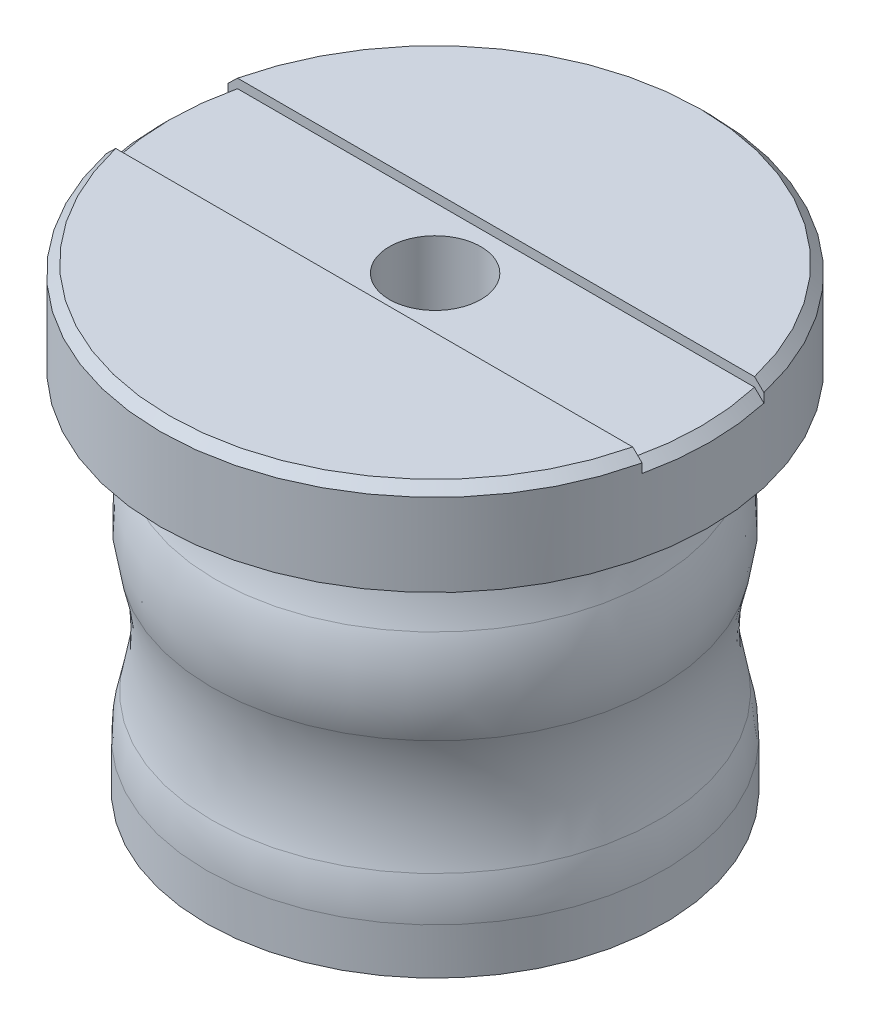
ISO-10303-21;
HEADER;
FILE_DESCRIPTION(('STEP AP214'),'2;1');
FILE_NAME('part.step','',(''),(''),'','','');
FILE_SCHEMA(('AUTOMOTIVE_DESIGN { 1 0 10303 214 1 1 1 1 }'));
ENDSEC;
DATA;
#1=APPLICATION_CONTEXT('core data for automotive mechanical design processes');
#2=APPLICATION_PROTOCOL_DEFINITION('international standard','automotive_design',2000,#1);
#3=PRODUCT_CONTEXT('',#1,'mechanical');
#4=PRODUCT('Part','Part','',(#3));
#5=PRODUCT_RELATED_PRODUCT_CATEGORY('part','',(#4));
#6=PRODUCT_DEFINITION_FORMATION('','',#4);
#7=PRODUCT_DEFINITION_CONTEXT('part definition',#1,'design');
#8=PRODUCT_DEFINITION('design','',#6,#7);
#9=PRODUCT_DEFINITION_SHAPE('','',#8);
#10=(LENGTH_UNIT() NAMED_UNIT(*) SI_UNIT(.MILLI.,.METRE.));
#11=(NAMED_UNIT(*) PLANE_ANGLE_UNIT() SI_UNIT($,.RADIAN.));
#12=(NAMED_UNIT(*) SI_UNIT($,.STERADIAN.) SOLID_ANGLE_UNIT());
#13=UNCERTAINTY_MEASURE_WITH_UNIT(LENGTH_MEASURE(1.E-05),#10,'distance_accuracy_value','');
#14=(GEOMETRIC_REPRESENTATION_CONTEXT(3) GLOBAL_UNCERTAINTY_ASSIGNED_CONTEXT((#13)) GLOBAL_UNIT_ASSIGNED_CONTEXT((#10,
#11,#12)) REPRESENTATION_CONTEXT('',''));
#15=CARTESIAN_POINT('',(0.,0.,0.));
#16=DIRECTION('',(0.,0.,1.));
#17=DIRECTION('',(1.,0.,0.));
#18=AXIS2_PLACEMENT_3D('',#15,#16,#17);
#19=CARTESIAN_POINT('',(-2.5,-3.99999999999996,0.));
#20=DIRECTION('',(0.,-1.,0.));
#21=DIRECTION('',(0.,0.,-1.));
#22=AXIS2_PLACEMENT_3D('',#19,#20,#21);
#23=PLANE('',#22);
#24=CARTESIAN_POINT('',(0.,-3.99999999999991,0.));
#25=DIRECTION('',(0.,1.,0.));
#26=DIRECTION('',(0.,0.,1.));
#27=AXIS2_PLACEMENT_3D('',#24,#25,#26);
#28=CIRCLE('',#27,2.49999999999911);
#29=CARTESIAN_POINT('',(0.,-3.99999999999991,2.49999999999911));
#30=VERTEX_POINT('',#29);
#31=EDGE_CURVE('E291',#30,#30,#28,.T.);
#32=ORIENTED_EDGE('',*,*,#31,.F.);
#33=EDGE_LOOP('',(#32));
#34=FACE_BOUND('',#33,.T.);
#35=CARTESIAN_POINT('',(0.,-3.99999999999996,0.));
#36=DIRECTION('',(0.,1.,0.));
#37=DIRECTION('',(0.,0.,1.));
#38=AXIS2_PLACEMENT_3D('',#35,#36,#37);
#39=CIRCLE('',#38,1.99999980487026);
#40=CARTESIAN_POINT('',(0.,-3.99999999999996,1.99999980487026));
#41=VERTEX_POINT('',#40);
#42=EDGE_CURVE('E163',#41,#41,#39,.T.);
#43=ORIENTED_EDGE('',*,*,#42,.T.);
#44=EDGE_LOOP('',(#43));
#45=FACE_BOUND('',#44,.T.);
#46=ADVANCED_FACE('F37',(#34,#45),#23,.T.);
#47=CARTESIAN_POINT('',(0.,1.,0.));
#48=DIRECTION('',(0.,1.,0.));
#49=DIRECTION('',(0.,0.,1.));
#50=AXIS2_PLACEMENT_3D('',#47,#48,#49);
#51=PLANE('',#50);
#52=DIRECTION('',(1.,0.,0.));
#53=VECTOR('',#52,1.);
#54=CARTESIAN_POINT('',(0.,1.,0.665));
#55=LINE('',#54,#53);
#56=CARTESIAN_POINT('',(-2.82272474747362,1.,0.665));
#57=VERTEX_POINT('',#56);
#58=CARTESIAN_POINT('',(2.82272474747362,1.,0.665));
#59=VERTEX_POINT('',#58);
#60=EDGE_CURVE('E306',#57,#59,#55,.T.);
#61=ORIENTED_EDGE('',*,*,#60,.F.);
#62=CARTESIAN_POINT('',(0.,1.,0.));
#63=DIRECTION('',(0.,1.,0.));
#64=DIRECTION('',(0.,0.,1.));
#65=AXIS2_PLACEMENT_3D('',#62,#63,#64);
#66=CIRCLE('',#65,2.9);
#67=EDGE_CURVE('E331',#57,#59,#66,.T.);
#68=ORIENTED_EDGE('',*,*,#67,.T.);
#69=EDGE_LOOP('',(#61,#68));
#70=FACE_BOUND('',#69,.T.);
#71=ADVANCED_FACE('F238',(#70),#51,.T.);
#72=CARTESIAN_POINT('',(0.,1.,0.));
#73=DIRECTION('',(0.,-1.,0.));
#74=DIRECTION('',(0.,0.,-1.));
#75=AXIS2_PLACEMENT_3D('',#72,#73,#74);
#76=CYLINDRICAL_SURFACE('',#75,3.);
#77=CARTESIAN_POINT('',(0.,0.9,0.));
#78=DIRECTION('',(0.,1.,0.));
#79=DIRECTION('',(0.,0.,1.));
#80=AXIS2_PLACEMENT_3D('',#77,#78,#79);
#81=CIRCLE('',#80,3.);
#82=CARTESIAN_POINT('',(2.9253674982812,0.9,0.665));
#83=VERTEX_POINT('',#82);
#84=CARTESIAN_POINT('',(-2.9253674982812,0.9,0.665));
#85=VERTEX_POINT('',#84);
#86=EDGE_CURVE('E324',#83,#85,#81,.F.);
#87=ORIENTED_EDGE('',*,*,#86,.T.);
#88=DIRECTION('',(0.,-1.,0.));
#89=VECTOR('',#88,1.);
#90=CARTESIAN_POINT('',(-2.9253674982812,1.,0.665));
#91=LINE('',#90,#89);
#92=CARTESIAN_POINT('',(-2.9253674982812,0.8,0.665));
#93=VERTEX_POINT('',#92);
#94=EDGE_CURVE('E64',#85,#93,#91,.T.);
#95=ORIENTED_EDGE('',*,*,#94,.T.);
#96=CARTESIAN_POINT('',(0.,0.8,0.));
#97=DIRECTION('',(0.,-1.,0.));
#98=DIRECTION('',(0.,0.,-1.));
#99=AXIS2_PLACEMENT_3D('',#96,#97,#98);
#100=CIRCLE('',#99,3.);
#101=CARTESIAN_POINT('',(-2.9253674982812,0.8,-0.665));
#102=VERTEX_POINT('',#101);
#103=EDGE_CURVE('E318',#93,#102,#100,.T.);
#104=ORIENTED_EDGE('',*,*,#103,.T.);
#105=DIRECTION('',(0.,-1.,0.));
#106=VECTOR('',#105,1.);
#107=CARTESIAN_POINT('',(-2.9253674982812,1.,-0.665));
#108=LINE('',#107,#106);
#109=CARTESIAN_POINT('',(-2.9253674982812,0.9,-0.665));
#110=VERTEX_POINT('',#109);
#111=EDGE_CURVE('E315',#102,#110,#108,.F.);
#112=ORIENTED_EDGE('',*,*,#111,.T.);
#113=CARTESIAN_POINT('',(0.,0.9,0.));
#114=DIRECTION('',(0.,1.,0.));
#115=DIRECTION('',(0.,0.,1.));
#116=AXIS2_PLACEMENT_3D('',#113,#114,#115);
#117=CIRCLE('',#116,3.);
#118=CARTESIAN_POINT('',(2.9253674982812,0.9,-0.665));
#119=VERTEX_POINT('',#118);
#120=EDGE_CURVE('E309',#110,#119,#117,.F.);
#121=ORIENTED_EDGE('',*,*,#120,.T.);
#122=DIRECTION('',(0.,-1.,0.));
#123=VECTOR('',#122,1.);
#124=CARTESIAN_POINT('',(2.9253674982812,1.,-0.665));
#125=LINE('',#124,#123);
#126=CARTESIAN_POINT('',(2.9253674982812,0.8,-0.665));
#127=VERTEX_POINT('',#126);
#128=EDGE_CURVE('E56',#119,#127,#125,.T.);
#129=ORIENTED_EDGE('',*,*,#128,.T.);
#130=CARTESIAN_POINT('',(0.,0.8,0.));
#131=DIRECTION('',(0.,-1.,0.));
#132=DIRECTION('',(0.,0.,-1.));
#133=AXIS2_PLACEMENT_3D('',#130,#131,#132);
#134=CIRCLE('',#133,3.);
#135=CARTESIAN_POINT('',(2.9253674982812,0.8,0.665));
#136=VERTEX_POINT('',#135);
#137=EDGE_CURVE('E312',#127,#136,#134,.T.);
#138=ORIENTED_EDGE('',*,*,#137,.T.);
#139=DIRECTION('',(0.,-1.,0.));
#140=VECTOR('',#139,1.);
#141=CARTESIAN_POINT('',(2.9253674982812,1.,0.665));
#142=LINE('',#141,#140);
#143=EDGE_CURVE('E321',#136,#83,#142,.F.);
#144=ORIENTED_EDGE('',*,*,#143,.T.);
#145=EDGE_LOOP('',(#87,#95,#104,#112,#121,#129,#138,#144));
#146=FACE_BOUND('',#145,.T.);
#147=CARTESIAN_POINT('',(0.,0.,0.));
#148=DIRECTION('',(0.,1.,0.));
#149=DIRECTION('',(0.,0.,1.));
#150=AXIS2_PLACEMENT_3D('',#147,#148,#149);
#151=CIRCLE('',#150,3.);
#152=CARTESIAN_POINT('',(0.,0.,3.));
#153=VERTEX_POINT('',#152);
#154=EDGE_CURVE('E300',#153,#153,#151,.T.);
#155=ORIENTED_EDGE('',*,*,#154,.T.);
#156=EDGE_LOOP('',(#155));
#157=FACE_BOUND('',#156,.T.);
#158=ADVANCED_FACE('F245',(#146,#157),#76,.T.);
#159=DIRECTION('',(-1.,0.,0.));
#160=VECTOR('',#159,1.);
#161=CARTESIAN_POINT('',(0.,1.,-0.665));
#162=LINE('',#161,#160);
#163=CARTESIAN_POINT('',(2.82272474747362,1.,-0.665));
#164=VERTEX_POINT('',#163);
#165=CARTESIAN_POINT('',(-2.82272474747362,1.,-0.665));
#166=VERTEX_POINT('',#165);
#167=EDGE_CURVE('E303',#164,#166,#162,.T.);
#168=ORIENTED_EDGE('',*,*,#167,.F.);
#169=CARTESIAN_POINT('',(0.,1.,0.));
#170=DIRECTION('',(0.,1.,0.));
#171=DIRECTION('',(0.,0.,1.));
#172=AXIS2_PLACEMENT_3D('',#169,#170,#171);
#173=CIRCLE('',#172,2.9);
#174=EDGE_CURVE('E389',#164,#166,#173,.T.);
#175=ORIENTED_EDGE('',*,*,#174,.T.);
#176=EDGE_LOOP('',(#168,#175));
#177=FACE_BOUND('',#176,.T.);
#178=ADVANCED_FACE('F248',(#177),#51,.T.);
#179=CARTESIAN_POINT('',(0.,0.,0.));
#180=DIRECTION('',(0.,1.,0.));
#181=DIRECTION('',(0.,0.,1.));
#182=AXIS2_PLACEMENT_3D('',#179,#180,#181);
#183=PLANE('',#182);
#184=CARTESIAN_POINT('',(0.,0.,0.));
#185=DIRECTION('',(0.,1.,0.));
#186=DIRECTION('',(0.,0.,1.));
#187=AXIS2_PLACEMENT_3D('',#184,#185,#186);
#188=CIRCLE('',#187,2.25);
#189=CARTESIAN_POINT('',(0.,0.,2.25));
#190=VERTEX_POINT('',#189);
#191=EDGE_CURVE('E270',#190,#190,#188,.T.);
#192=ORIENTED_EDGE('',*,*,#191,.T.);
#193=EDGE_LOOP('',(#192));
#194=FACE_BOUND('',#193,.T.);
#195=ORIENTED_EDGE('',*,*,#154,.F.);
#196=EDGE_LOOP('',(#195));
#197=FACE_BOUND('',#196,.T.);
#198=ADVANCED_FACE('F379',(#194,#197),#183,.F.);
#199=CARTESIAN_POINT('',(0.,0.9,0.));
#200=DIRECTION('',(0.,-1.,0.));
#201=DIRECTION('',(0.,0.,-1.));
#202=AXIS2_PLACEMENT_3D('',#199,#200,#201);
#203=PLANE('',#202);
#204=CARTESIAN_POINT('',(0.,0.9,0.));
#205=DIRECTION('',(0.,1.,0.));
#206=DIRECTION('',(0.,0.,1.));
#207=AXIS2_PLACEMENT_3D('',#204,#205,#206);
#208=CIRCLE('',#207,0.5);
#209=CARTESIAN_POINT('',(0.,0.9,0.5));
#210=VERTEX_POINT('',#209);
#211=EDGE_CURVE('E271',#210,#210,#208,.T.);
#212=ORIENTED_EDGE('',*,*,#211,.F.);
#213=EDGE_LOOP('',(#212));
#214=FACE_BOUND('',#213,.T.);
#215=DIRECTION('',(-1.,0.,0.));
#216=VECTOR('',#215,1.);
#217=CARTESIAN_POINT('',(-4.25,0.9,-0.665));
#218=LINE('',#217,#216);
#219=CARTESIAN_POINT('',(2.82272474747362,0.9,-0.665));
#220=VERTEX_POINT('',#219);
#221=CARTESIAN_POINT('',(-2.82272474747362,0.9,-0.665));
#222=VERTEX_POINT('',#221);
#223=EDGE_CURVE('E294',#220,#222,#218,.T.);
#224=ORIENTED_EDGE('',*,*,#223,.T.);
#225=CARTESIAN_POINT('',(0.,0.9,0.));
#226=DIRECTION('',(0.,-1.,0.));
#227=DIRECTION('',(0.,0.,-1.));
#228=AXIS2_PLACEMENT_3D('',#225,#226,#227);
#229=CIRCLE('',#228,2.9);
#230=CARTESIAN_POINT('',(-2.82272474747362,0.9,0.665));
#231=VERTEX_POINT('',#230);
#232=EDGE_CURVE('E329',#222,#231,#229,.F.);
#233=ORIENTED_EDGE('',*,*,#232,.T.);
#234=DIRECTION('',(1.,0.,0.));
#235=VECTOR('',#234,1.);
#236=CARTESIAN_POINT('',(-4.25,0.9,0.665));
#237=LINE('',#236,#235);
#238=CARTESIAN_POINT('',(2.82272474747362,0.9,0.665));
#239=VERTEX_POINT('',#238);
#240=EDGE_CURVE('E297',#231,#239,#237,.T.);
#241=ORIENTED_EDGE('',*,*,#240,.T.);
#242=CARTESIAN_POINT('',(0.,0.9,0.));
#243=DIRECTION('',(0.,-1.,0.));
#244=DIRECTION('',(0.,0.,-1.));
#245=AXIS2_PLACEMENT_3D('',#242,#243,#244);
#246=CIRCLE('',#245,2.9);
#247=EDGE_CURVE('E327',#239,#220,#246,.F.);
#248=ORIENTED_EDGE('',*,*,#247,.T.);
#249=EDGE_LOOP('',(#224,#233,#241,#248));
#250=FACE_BOUND('',#249,.T.);
#251=ADVANCED_FACE('F351',(#214,#250),#203,.F.);
#252=CARTESIAN_POINT('',(-4.25,0.9,0.665));
#253=DIRECTION('',(0.,0.,1.));
#254=DIRECTION('',(1.,0.,0.));
#255=AXIS2_PLACEMENT_3D('',#252,#253,#254);
#256=PLANE('',#255);
#257=ORIENTED_EDGE('',*,*,#60,.T.);
#258=CARTESIAN_POINT('',(2.82272474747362,1.,0.665));
#259=CARTESIAN_POINT('',(2.83983943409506,0.983341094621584,0.665));
#260=CARTESIAN_POINT('',(2.85695033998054,0.966678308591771,0.665));
#261=CARTESIAN_POINT('',(2.89116459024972,0.933344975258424,0.665));
#262=CARTESIAN_POINT('',(2.90826793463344,0.916674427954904,0.665));
#263=CARTESIAN_POINT('',(2.9253674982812,0.9,0.665));
#264=B_SPLINE_CURVE_WITH_KNOTS('',3,(#258,#259,#260,#261,#262,#263),.UNSPECIFIED.,.F.,.F.,(4,2,
4),(0.,0.0716511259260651,0.143302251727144),.UNSPECIFIED.);
#265=EDGE_CURVE('E341',#59,#83,#264,.T.);
#266=ORIENTED_EDGE('',*,*,#265,.T.);
#267=ORIENTED_EDGE('',*,*,#143,.F.);
#268=CARTESIAN_POINT('',(2.9253674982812,0.8,0.665));
#269=CARTESIAN_POINT('',(2.90826793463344,0.816674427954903,0.665));
#270=CARTESIAN_POINT('',(2.89116459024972,0.833344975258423,0.665));
#271=CARTESIAN_POINT('',(2.85695033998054,0.86667830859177,0.665));
#272=CARTESIAN_POINT('',(2.83983943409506,0.883341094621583,0.665));
#273=CARTESIAN_POINT('',(2.82272474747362,0.9,0.665));
#274=B_SPLINE_CURVE_WITH_KNOTS('',3,(#268,#269,#270,#271,#272,#273),.UNSPECIFIED.,.F.,.F.,(4,2,
4),(0.,0.0716511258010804,0.143302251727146),.UNSPECIFIED.);
#275=EDGE_CURVE('E50',#136,#239,#274,.T.);
#276=ORIENTED_EDGE('',*,*,#275,.T.);
#277=ORIENTED_EDGE('',*,*,#240,.F.);
#278=CARTESIAN_POINT('',(-2.82272474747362,0.9,0.665));
#279=CARTESIAN_POINT('',(-2.83983943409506,0.883341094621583,0.665));
#280=CARTESIAN_POINT('',(-2.85695033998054,0.86667830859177,0.665));
#281=CARTESIAN_POINT('',(-2.89116459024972,0.833344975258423,0.665));
#282=CARTESIAN_POINT('',(-2.90826793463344,0.816674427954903,0.665));
#283=CARTESIAN_POINT('',(-2.9253674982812,0.8,0.665));
#284=B_SPLINE_CURVE_WITH_KNOTS('',3,(#278,#279,#280,#281,#282,#283),.UNSPECIFIED.,.F.,.F.,(4,2,
4),(0.,0.0716511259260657,0.143302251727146),.UNSPECIFIED.);
#285=EDGE_CURVE('E357',#231,#93,#284,.T.);
#286=ORIENTED_EDGE('',*,*,#285,.T.);
#287=ORIENTED_EDGE('',*,*,#94,.F.);
#288=CARTESIAN_POINT('',(-2.9253674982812,0.9,0.665));
#289=CARTESIAN_POINT('',(-2.90826793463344,0.916674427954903,0.665));
#290=CARTESIAN_POINT('',(-2.89116459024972,0.933344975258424,0.665));
#291=CARTESIAN_POINT('',(-2.85695033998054,0.96667830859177,0.665));
#292=CARTESIAN_POINT('',(-2.83983943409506,0.983341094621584,0.665));
#293=CARTESIAN_POINT('',(-2.82272474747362,1.,0.665));
#294=B_SPLINE_CURVE_WITH_KNOTS('',3,(#288,#289,#290,#291,#292,#293),.UNSPECIFIED.,.F.,.F.,(4,2,
4),(0.,0.0716511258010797,0.143302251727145),.UNSPECIFIED.);
#295=EDGE_CURVE('E334',#85,#57,#294,.T.);
#296=ORIENTED_EDGE('',*,*,#295,.T.);
#297=EDGE_LOOP('',(#257,#266,#267,#276,#277,#286,#287,#296));
#298=FACE_BOUND('',#297,.T.);
#299=ADVANCED_FACE('F263',(#298),#256,.F.);
#300=CARTESIAN_POINT('',(-4.25,0.9,-0.665));
#301=DIRECTION('',(0.,0.,-1.));
#302=DIRECTION('',(-1.,0.,0.));
#303=AXIS2_PLACEMENT_3D('',#300,#301,#302);
#304=PLANE('',#303);
#305=ORIENTED_EDGE('',*,*,#167,.T.);
#306=CARTESIAN_POINT('',(-2.82272474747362,1.,-0.665));
#307=CARTESIAN_POINT('',(-2.83983943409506,0.983341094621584,-0.665));
#308=CARTESIAN_POINT('',(-2.85695033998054,0.96667830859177,-0.665));
#309=CARTESIAN_POINT('',(-2.89116459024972,0.933344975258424,-0.665));
#310=CARTESIAN_POINT('',(-2.90826793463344,0.916674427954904,-0.665));
#311=CARTESIAN_POINT('',(-2.9253674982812,0.9,-0.665));
#312=B_SPLINE_CURVE_WITH_KNOTS('',3,(#306,#307,#308,#309,#310,#311),.UNSPECIFIED.,.F.,.F.,(4,2,
4),(0.,0.0716511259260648,0.143302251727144),.UNSPECIFIED.);
#313=EDGE_CURVE('E394',#166,#110,#312,.T.);
#314=ORIENTED_EDGE('',*,*,#313,.T.);
#315=ORIENTED_EDGE('',*,*,#111,.F.);
#316=CARTESIAN_POINT('',(-2.9253674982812,0.8,-0.665));
#317=CARTESIAN_POINT('',(-2.90826793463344,0.816674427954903,-0.665));
#318=CARTESIAN_POINT('',(-2.89116459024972,0.833344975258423,-0.665));
#319=CARTESIAN_POINT('',(-2.85695033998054,0.86667830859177,-0.665));
#320=CARTESIAN_POINT('',(-2.83983943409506,0.883341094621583,-0.665));
#321=CARTESIAN_POINT('',(-2.82272474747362,0.9,-0.665));
#322=B_SPLINE_CURVE_WITH_KNOTS('',3,(#316,#317,#318,#319,#320,#321),.UNSPECIFIED.,.F.,.F.,(4,2,
4),(0.,0.0716511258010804,0.143302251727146),.UNSPECIFIED.);
#323=EDGE_CURVE('E362',#102,#222,#322,.T.);
#324=ORIENTED_EDGE('',*,*,#323,.T.);
#325=ORIENTED_EDGE('',*,*,#223,.F.);
#326=CARTESIAN_POINT('',(2.82272474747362,0.9,-0.665));
#327=CARTESIAN_POINT('',(2.83983943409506,0.883341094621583,-0.665));
#328=CARTESIAN_POINT('',(2.85695033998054,0.86667830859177,-0.665));
#329=CARTESIAN_POINT('',(2.89116459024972,0.833344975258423,-0.665));
#330=CARTESIAN_POINT('',(2.90826793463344,0.816674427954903,-0.665));
#331=CARTESIAN_POINT('',(2.9253674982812,0.8,-0.665));
#332=B_SPLINE_CURVE_WITH_KNOTS('',3,(#326,#327,#328,#329,#330,#331),.UNSPECIFIED.,.F.,.F.,(4,2,
4),(0.,0.0716511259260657,0.143302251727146),.UNSPECIFIED.);
#333=EDGE_CURVE('E11',#220,#127,#332,.T.);
#334=ORIENTED_EDGE('',*,*,#333,.T.);
#335=ORIENTED_EDGE('',*,*,#128,.F.);
#336=CARTESIAN_POINT('',(2.9253674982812,0.9,-0.665));
#337=CARTESIAN_POINT('',(2.90826793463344,0.916674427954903,-0.665));
#338=CARTESIAN_POINT('',(2.89116459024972,0.933344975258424,-0.665));
#339=CARTESIAN_POINT('',(2.85695033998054,0.96667830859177,-0.665));
#340=CARTESIAN_POINT('',(2.83983943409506,0.983341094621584,-0.665));
#341=CARTESIAN_POINT('',(2.82272474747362,1.,-0.665));
#342=B_SPLINE_CURVE_WITH_KNOTS('',3,(#336,#337,#338,#339,#340,#341),.UNSPECIFIED.,.F.,.F.,(4,2,
4),(0.,0.0716511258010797,0.143302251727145),.UNSPECIFIED.);
#343=EDGE_CURVE('E393',#119,#164,#342,.T.);
#344=ORIENTED_EDGE('',*,*,#343,.T.);
#345=EDGE_LOOP('',(#305,#314,#315,#324,#325,#334,#335,#344));
#346=FACE_BOUND('',#345,.T.);
#347=ADVANCED_FACE('F255',(#346),#304,.F.);
#348=CARTESIAN_POINT('',(0.,-3.99999999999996,0.));
#349=DIRECTION('',(0.,-1.,0.));
#350=DIRECTION('',(0.,0.,-1.));
#351=AXIS2_PLACEMENT_3D('',#348,#349,#350);
#352=CIRCLE('',#351,1.);
#353=CARTESIAN_POINT('',(0.,-3.99999999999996,-1.));
#354=VERTEX_POINT('',#353);
#355=EDGE_CURVE('E167',#354,#354,#352,.F.);
#356=ORIENTED_EDGE('',*,*,#355,.F.);
#357=EDGE_LOOP('',(#356));
#358=FACE_BOUND('',#357,.T.);
#359=CARTESIAN_POINT('',(0.,-3.99999999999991,0.));
#360=DIRECTION('',(0.,1.,0.));
#361=DIRECTION('',(0.,0.,1.));
#362=AXIS2_PLACEMENT_3D('',#359,#360,#361);
#363=CIRCLE('',#362,0.5);
#364=CARTESIAN_POINT('',(0.,-3.99999999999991,0.5));
#365=VERTEX_POINT('',#364);
#366=EDGE_CURVE('E268',#365,#365,#363,.T.);
#367=ORIENTED_EDGE('',*,*,#366,.T.);
#368=EDGE_LOOP('',(#367));
#369=FACE_BOUND('',#368,.T.);
#370=ADVANCED_FACE('F241',(#358,#369),#23,.T.);
#371=CARTESIAN_POINT('',(0.,-3.74799099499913,0.));
#372=DIRECTION('',(0.,1.,0.));
#373=DIRECTION('',(0.,0.,1.));
#374=AXIS2_PLACEMENT_3D('',#371,#372,#373);
#375=TOROIDAL_SURFACE('',#374,287.499888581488,284.999999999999);
#376=ORIENTED_EDGE('',*,*,#31,.T.);
#377=EDGE_LOOP('',(#376));
#378=FACE_BOUND('',#377,.T.);
#379=CARTESIAN_POINT('',(0.,-3.49667583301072,0.));
#380=DIRECTION('',(0.,1.,0.));
#381=DIRECTION('',(0.,0.,1.));
#382=AXIS2_PLACEMENT_3D('',#379,#380,#381);
#383=CIRCLE('',#382,2.49999938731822);
#384=CARTESIAN_POINT('',(0.,-3.49667583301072,2.49999938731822));
#385=VERTEX_POINT('',#384);
#386=EDGE_CURVE('E288',#385,#385,#383,.T.);
#387=ORIENTED_EDGE('',*,*,#386,.F.);
#388=EDGE_LOOP('',(#387));
#389=FACE_BOUND('',#388,.T.);
#390=ADVANCED_FACE('F254',(#378,#389),#375,.F.);
#391=CARTESIAN_POINT('',(0.,-3.4952862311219,0.));
#392=DIRECTION('',(0.,1.,0.));
#393=DIRECTION('',(0.,0.,1.));
#394=AXIS2_PLACEMENT_3D('',#391,#392,#393);
#395=DEGENERATE_TOROIDAL_SURFACE('',#394,0.924143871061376,1.57585612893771,.T.);
#396=ORIENTED_EDGE('',*,*,#386,.T.);
#397=EDGE_LOOP('',(#396));
#398=FACE_BOUND('',#397,.T.);
#399=CARTESIAN_POINT('',(0.,-3.0555906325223,0.));
#400=DIRECTION('',(0.,1.,0.));
#401=DIRECTION('',(0.,0.,1.));
#402=AXIS2_PLACEMENT_3D('',#399,#400,#401);
#403=CIRCLE('',#402,2.43741526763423);
#404=CARTESIAN_POINT('',(0.,-3.0555906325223,2.43741526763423));
#405=VERTEX_POINT('',#404);
#406=EDGE_CURVE('E285',#405,#405,#403,.T.);
#407=ORIENTED_EDGE('',*,*,#406,.F.);
#408=EDGE_LOOP('',(#407));
#409=FACE_BOUND('',#408,.T.);
#410=ADVANCED_FACE('F261',(#398,#409),#395,.T.);
#411=CARTESIAN_POINT('',(0.,-2.42779531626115,0.));
#412=DIRECTION('',(0.,1.,0.));
#413=DIRECTION('',(0.,0.,1.));
#414=AXIS2_PLACEMENT_3D('',#411,#412,#413);
#415=TOROIDAL_SURFACE('',#414,4.59805707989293,2.25);
#416=ORIENTED_EDGE('',*,*,#406,.T.);
#417=EDGE_LOOP('',(#416));
#418=FACE_BOUND('',#417,.T.);
#419=CARTESIAN_POINT('',(0.,-1.8,0.));
#420=DIRECTION('',(0.,1.,0.));
#421=DIRECTION('',(0.,0.,1.));
#422=AXIS2_PLACEMENT_3D('',#419,#420,#421);
#423=CIRCLE('',#422,2.43741526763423);
#424=CARTESIAN_POINT('',(0.,-1.8,2.43741526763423));
#425=VERTEX_POINT('',#424);
#426=EDGE_CURVE('E282',#425,#425,#423,.T.);
#427=ORIENTED_EDGE('',*,*,#426,.F.);
#428=EDGE_LOOP('',(#427));
#429=FACE_BOUND('',#428,.T.);
#430=ADVANCED_FACE('F543',(#418,#429),#415,.F.);
#431=CARTESIAN_POINT('',(0.,-1.3603044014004,0.));
#432=DIRECTION('',(0.,1.,0.));
#433=DIRECTION('',(0.,0.,1.));
#434=AXIS2_PLACEMENT_3D('',#431,#432,#433);
#435=DEGENERATE_TOROIDAL_SURFACE('',#434,0.924143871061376,1.57585612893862,.T.);
#436=ORIENTED_EDGE('',*,*,#426,.T.);
#437=EDGE_LOOP('',(#436));
#438=FACE_BOUND('',#437,.T.);
#439=CARTESIAN_POINT('',(0.,-0.8,0.));
#440=DIRECTION('',(0.,1.,0.));
#441=DIRECTION('',(0.,0.,1.));
#442=AXIS2_PLACEMENT_3D('',#439,#440,#441);
#443=CIRCLE('',#442,2.39702591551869);
#444=CARTESIAN_POINT('',(0.,-0.8,2.39702591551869));
#445=VERTEX_POINT('',#444);
#446=EDGE_CURVE('E274',#445,#445,#443,.T.);
#447=ORIENTED_EDGE('',*,*,#446,.F.);
#448=EDGE_LOOP('',(#447));
#449=FACE_BOUND('',#448,.T.);
#450=ADVANCED_FACE('F533',(#438,#449),#435,.T.);
#451=CARTESIAN_POINT('',(0.,0.,0.));
#452=DIRECTION('',(0.,1.,0.));
#453=DIRECTION('',(0.,0.,1.));
#454=AXIS2_PLACEMENT_3D('',#451,#452,#453);
#455=TOROIDAL_SURFACE('',#454,4.5,2.25);
#456=ORIENTED_EDGE('',*,*,#446,.T.);
#457=EDGE_LOOP('',(#456));
#458=FACE_BOUND('',#457,.T.);
#459=ORIENTED_EDGE('',*,*,#191,.F.);
#460=EDGE_LOOP('',(#459));
#461=FACE_BOUND('',#460,.T.);
#462=ADVANCED_FACE('F525',(#458,#461),#455,.F.);
#463=CARTESIAN_POINT('',(0.,-3.99999999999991,0.));
#464=DIRECTION('',(0.,1.,0.));
#465=DIRECTION('',(0.,0.,1.));
#466=AXIS2_PLACEMENT_3D('',#463,#464,#465);
#467=CYLINDRICAL_SURFACE('',#466,0.5);
#468=ORIENTED_EDGE('',*,*,#366,.F.);
#469=EDGE_LOOP('',(#468));
#470=FACE_BOUND('',#469,.T.);
#471=ORIENTED_EDGE('',*,*,#211,.T.);
#472=EDGE_LOOP('',(#471));
#473=FACE_BOUND('',#472,.T.);
#474=ADVANCED_FACE('F197',(#470,#473),#467,.F.);
#475=CARTESIAN_POINT('',(0.,0.,0.));
#476=DIRECTION('',(0.,1.,0.));
#477=DIRECTION('',(0.,0.,1.));
#478=AXIS2_PLACEMENT_3D('',#475,#476,#477);
#479=TOROIDAL_SURFACE('',#478,4.5,2.75);
#480=CARTESIAN_POINT('',(0.,-0.977777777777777,0.));
#481=DIRECTION('',(0.,1.,0.));
#482=DIRECTION('',(0.,0.,1.));
#483=AXIS2_PLACEMENT_3D('',#480,#481,#482);
#484=CIRCLE('',#483,1.92969834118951);
#485=CARTESIAN_POINT('',(0.,-0.977777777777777,1.92969834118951));
#486=VERTEX_POINT('',#485);
#487=EDGE_CURVE('E137',#486,#486,#484,.T.);
#488=ORIENTED_EDGE('',*,*,#487,.F.);
#489=EDGE_LOOP('',(#488));
#490=FACE_BOUND('',#489,.T.);
#491=CARTESIAN_POINT('',(0.,0.4,0.));
#492=DIRECTION('',(0.,1.,0.));
#493=DIRECTION('',(0.,0.,1.));
#494=AXIS2_PLACEMENT_3D('',#491,#492,#493);
#495=CIRCLE('',#494,1.77924642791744);
#496=CARTESIAN_POINT('',(1.34480216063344,0.4,1.165));
#497=VERTEX_POINT('',#496);
#498=CARTESIAN_POINT('',(1.34480216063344,0.39999999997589,-1.165));
#499=VERTEX_POINT('',#498);
#500=EDGE_CURVE('E277',#497,#499,#495,.T.);
#501=ORIENTED_EDGE('',*,*,#500,.T.);
#502=CARTESIAN_POINT('',(1.35942126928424,0.469193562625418,-1.165));
#503=CARTESIAN_POINT('',(1.38819102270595,0.595323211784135,-1.165));
#504=CARTESIAN_POINT('',(1.42800451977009,0.719001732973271,-1.165));
#505=CARTESIAN_POINT('',(1.52589284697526,0.95903724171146,-1.165));
#506=CARTESIAN_POINT('',(1.58401825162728,1.07537286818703,-1.165));
#507=CARTESIAN_POINT('',(1.73844837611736,1.33890516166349,-1.165));
#508=CARTESIAN_POINT('',(1.84098538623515,1.48246282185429,-1.165));
#509=CARTESIAN_POINT('',(2.0680545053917,1.75085405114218,-1.165));
#510=CARTESIAN_POINT('',(2.19259656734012,1.87567910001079,-1.165));
#511=CARTESIAN_POINT('',(2.46101754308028,2.10463127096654,-1.165));
#512=CARTESIAN_POINT('',(2.60502736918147,2.20860527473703,-1.165));
#513=CARTESIAN_POINT('',(2.90809203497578,2.3915433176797,-1.165));
#514=CARTESIAN_POINT('',(3.06714054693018,2.47051781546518,-1.165));
#515=CARTESIAN_POINT('',(3.40038866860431,2.60215231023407,-1.165));
#516=CARTESIAN_POINT('',(3.57486470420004,2.65411734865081,-1.165));
#517=CARTESIAN_POINT('',(3.93033970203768,2.72613532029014,-1.165));
#518=CARTESIAN_POINT('',(4.11133824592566,2.74619029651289,-1.165));
#519=CARTESIAN_POINT('',(4.46394648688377,2.75264043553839,-1.165));
#520=CARTESIAN_POINT('',(4.63552334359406,2.74083130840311,-1.165));
#521=CARTESIAN_POINT('',(4.97387857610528,2.68703465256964,-1.165));
#522=CARTESIAN_POINT('',(5.14065854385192,2.6450572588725,-1.165));
#523=CARTESIAN_POINT('',(5.45600188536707,2.53454839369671,-1.165));
#524=CARTESIAN_POINT('',(5.60505745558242,2.46741922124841,-1.165));
#525=CARTESIAN_POINT('',(5.88925630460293,2.30830192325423,-1.165));
#526=CARTESIAN_POINT('',(6.02440217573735,2.21631844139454,-1.165));
#527=CARTESIAN_POINT('',(6.27249898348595,2.0133266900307,-1.165));
#528=CARTESIAN_POINT('',(6.38601412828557,1.90300746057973,-1.165));
#529=CARTESIAN_POINT('',(6.59247899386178,1.6645596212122,-1.165));
#530=CARTESIAN_POINT('',(6.68543106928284,1.53643305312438,-1.165));
#531=CARTESIAN_POINT('',(6.84636932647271,1.26861258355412,-1.165));
#532=CARTESIAN_POINT('',(6.91478829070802,1.12917859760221,-1.165));
#533=CARTESIAN_POINT('',(7.0269761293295,0.840723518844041,-1.165));
#534=CARTESIAN_POINT('',(7.07074657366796,0.691703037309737,-1.165));
#535=CARTESIAN_POINT('',(7.13199931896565,0.389908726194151,-1.165));
#536=CARTESIAN_POINT('',(7.14973980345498,0.237187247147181,-1.165));
#537=CARTESIAN_POINT('',(7.15922826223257,-0.0690593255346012,-1.165));
#538=CARTESIAN_POINT('',(7.15097699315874,-0.222584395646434,-1.165));
#539=CARTESIAN_POINT('',(7.10880614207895,-0.525505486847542,-1.165));
#540=CARTESIAN_POINT('',(7.07497816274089,-0.674914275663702,-1.165));
#541=CARTESIAN_POINT('',(6.98276775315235,-0.965948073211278,-1.165));
#542=CARTESIAN_POINT('',(6.92438538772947,-1.10757310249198,-1.165));
#543=CARTESIAN_POINT('',(6.78464606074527,-1.37935885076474,-1.165));
#544=CARTESIAN_POINT('',(6.70324207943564,-1.50949538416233,-1.165));
#545=CARTESIAN_POINT('',(6.51990282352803,-1.75438976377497,-1.165));
#546=CARTESIAN_POINT('',(6.41796707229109,-1.86914725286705,-1.165));
#547=CARTESIAN_POINT('',(6.19563283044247,-2.08105656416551,-1.165));
#548=CARTESIAN_POINT('',(6.07509319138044,-2.17806023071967,-1.165));
#549=CARTESIAN_POINT('',(5.81964711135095,-2.35080487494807,-1.165));
#550=CARTESIAN_POINT('',(5.68473990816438,-2.42654472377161,-1.165));
#551=CARTESIAN_POINT('',(5.40220742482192,-2.55593811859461,-1.165));
#552=CARTESIAN_POINT('',(5.25441830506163,-2.60923364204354,-1.165));
#553=CARTESIAN_POINT('',(4.95212888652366,-2.69092502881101,-1.165));
#554=CARTESIAN_POINT('',(4.79762806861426,-2.71931896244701,-1.165));
#555=CARTESIAN_POINT('',(4.48210522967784,-2.75129750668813,-1.165));
#556=CARTESIAN_POINT('',(4.32101741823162,-2.75423032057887,-1.165));
#557=CARTESIAN_POINT('',(4.00048667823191,-2.7340764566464,-1.165));
#558=CARTESIAN_POINT('',(3.84104411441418,-2.71098412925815,-1.165));
#559=CARTESIAN_POINT('',(3.52156739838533,-2.63859721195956,-1.165));
#560=CARTESIAN_POINT('',(3.36176141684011,-2.58829805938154,-1.165));
#561=CARTESIAN_POINT('',(3.05222531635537,-2.46297807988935,-1.165));
#562=CARTESIAN_POINT('',(2.90249455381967,-2.38795883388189,-1.165));
#563=CARTESIAN_POINT('',(2.60871191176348,-2.21104207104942,-1.165));
#564=CARTESIAN_POINT('',(2.46540439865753,-2.10791094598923,-1.165));
#565=CARTESIAN_POINT('',(2.19685559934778,-1.87975878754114,-1.165));
#566=CARTESIAN_POINT('',(2.07164877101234,-1.7546969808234,-1.165));
#567=CARTESIAN_POINT('',(1.89811645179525,-1.55019385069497,-1.165));
#568=CARTESIAN_POINT('',(1.84165917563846,-1.47753736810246,-1.165));
#569=CARTESIAN_POINT('',(1.73546906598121,-1.32746997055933,-1.165));
#570=CARTESIAN_POINT('',(1.68573782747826,-1.25005793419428,-1.165));
#571=CARTESIAN_POINT('',(1.54816371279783,-1.01159785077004,-1.165));
#572=CARTESIAN_POINT('',(1.47142344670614,-0.843727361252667,-1.165));
#573=CARTESIAN_POINT('',(1.3775605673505,-0.554815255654,-1.165));
#574=CARTESIAN_POINT('',(1.34901580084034,-0.437477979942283,-1.165));
#575=CARTESIAN_POINT('',(1.32137208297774,-0.259270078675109,-1.165));
#576=CARTESIAN_POINT('',(1.31468580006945,-0.199543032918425,-1.165));
#577=CARTESIAN_POINT('',(1.30653889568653,-0.0797422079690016,-1.165));
#578=CARTESIAN_POINT('',(1.30507696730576,-0.0196685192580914,-1.165));
#579=CARTESIAN_POINT('',(1.30767849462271,0.112483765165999,-1.165));
#580=CARTESIAN_POINT('',(1.31291470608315,0.184542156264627,-1.165));
#581=CARTESIAN_POINT('',(1.3307616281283,0.327719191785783,-1.165));
#582=CARTESIAN_POINT('',(1.34337333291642,0.398837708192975,-1.165));
#583=CARTESIAN_POINT('',(1.35942126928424,0.469193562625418,-1.165));
#584=B_SPLINE_CURVE_WITH_KNOTS('',3,(#502,#503,#504,#505,#506,#507,#508,#509,#510,#511,#512,
#513,#514,#515,#516,#517,#518,#519,#520,#521,#522,#523,#524,#525,#526,#527,#528,#529,#530,#531,
#532,#533,#534,#535,#536,#537,#538,#539,#540,#541,#542,#543,#544,#545,#546,#547,#548,#549,#550,
#551,#552,#553,#554,#555,#556,#557,#558,#559,#560,#561,#562,#563,#564,#565,#566,#567,#568,#569,
#570,#571,#572,#573,#574,#575,#576,#577,#578,#579,#580,#581,#582,#583),.UNSPECIFIED.,.T.,.F.,(4,
2,2,2,2,2,2,2,2,2,2,2,2,2,2,2,2,2,2,2,2,2,2,2,2,2,2,2,2,2,2,2,2,2,2,2,2,2,2,2,4),(0.,
0.387871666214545,0.776824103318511,1.30335310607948,1.83012087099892,2.36062565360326,
2.89090820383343,3.43423271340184,3.97752243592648,4.49084335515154,5.00399190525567,
5.49199012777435,5.9798972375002,6.45246499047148,6.92497860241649,7.38869083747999,
7.85237353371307,8.31142525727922,8.77046361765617,9.22786567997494,9.6852665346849,
10.1436084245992,10.6019609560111,11.0639795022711,11.5260225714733,11.995179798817,
12.4643733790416,12.9455438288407,13.4268187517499,13.9272146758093,14.4275786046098,
14.9549871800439,15.4833869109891,15.7590914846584,16.0348613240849,16.5840610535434,
16.9447499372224,17.1248423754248,17.3048897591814,17.521217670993,17.7375747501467),.UNSPECIFIED.);
#585=CARTESIAN_POINT('',(1.36667622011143,0.5,-1.165));
#586=VERTEX_POINT('',#585);
#587=EDGE_CURVE('E149',#499,#586,#584,.T.);
#588=ORIENTED_EDGE('',*,*,#587,.T.);
#589=CARTESIAN_POINT('',(0.,0.5,0.));
#590=DIRECTION('',(0.,-1.,0.));
#591=DIRECTION('',(0.,0.,-1.));
#592=AXIS2_PLACEMENT_3D('',#589,#590,#591);
#593=CIRCLE('',#592,1.79583654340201);
#594=CARTESIAN_POINT('',(-1.36667622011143,0.5,-1.165));
#595=VERTEX_POINT('',#594);
#596=EDGE_CURVE('E138',#586,#595,#593,.F.);
#597=ORIENTED_EDGE('',*,*,#596,.T.);
#598=CARTESIAN_POINT('',(-1.35942126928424,0.469193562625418,-1.165));
#599=CARTESIAN_POINT('',(-1.34492152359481,0.405612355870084,-1.165));
#600=CARTESIAN_POINT('',(-1.33322120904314,0.34139816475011,-1.165));
#601=CARTESIAN_POINT('',(-1.31580924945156,0.212142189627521,-1.165));
#602=CARTESIAN_POINT('',(-1.3100983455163,0.147100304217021,-1.165));
#603=CARTESIAN_POINT('',(-1.30489634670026,0.0167647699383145,-1.165));
#604=CARTESIAN_POINT('',(-1.30540516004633,-0.0485288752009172,-1.165));
#605=CARTESIAN_POINT('',(-1.31261106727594,-0.178753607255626,-1.165));
#606=CARTESIAN_POINT('',(-1.319307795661,-0.243684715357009,-1.165));
#607=CARTESIAN_POINT('',(-1.3464170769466,-0.424334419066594,-1.165));
#608=CARTESIAN_POINT('',(-1.37351807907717,-0.539097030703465,-1.165));
#609=CARTESIAN_POINT('',(-1.44439007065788,-0.763322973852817,-1.165));
#610=CARTESIAN_POINT('',(-1.48818449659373,-0.872778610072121,-1.165));
#611=CARTESIAN_POINT('',(-1.61116198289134,-1.1301955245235,-1.165));
#612=CARTESIAN_POINT('',(-1.69747514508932,-1.27476022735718,-1.165));
#613=CARTESIAN_POINT('',(-1.89228524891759,-1.54803247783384,-1.165));
#614=CARTESIAN_POINT('',(-2.00080798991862,-1.67672130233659,-1.165));
#615=CARTESIAN_POINT('',(-2.2378249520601,-1.91744131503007,-1.165));
#616=CARTESIAN_POINT('',(-2.36655557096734,-2.02923988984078,-1.165));
#617=CARTESIAN_POINT('',(-2.63976536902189,-2.23142968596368,-1.165));
#618=CARTESIAN_POINT('',(-2.78423761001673,-2.32183028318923,-1.165));
#619=CARTESIAN_POINT('',(-3.09736466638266,-2.48457164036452,-1.165));
#620=CARTESIAN_POINT('',(-3.26702441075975,-2.55499476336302,-1.165));
#621=CARTESIAN_POINT('',(-3.61618148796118,-2.66480083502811,-1.165));
#622=CARTESIAN_POINT('',(-3.79567946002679,-2.70418176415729,-1.165));
#623=CARTESIAN_POINT('',(-4.15036215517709,-2.74857371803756,-1.165));
#624=CARTESIAN_POINT('',(-4.32535565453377,-2.75510685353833,-1.165));
#625=CARTESIAN_POINT('',(-4.67371402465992,-2.73693231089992,-1.165));
#626=CARTESIAN_POINT('',(-4.84707945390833,-2.71223577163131,-1.165));
#627=CARTESIAN_POINT('',(-5.17730386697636,-2.6339624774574,-1.165));
#628=CARTESIAN_POINT('',(-5.33454905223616,-2.58201168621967,-1.165));
#629=CARTESIAN_POINT('',(-5.63756547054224,-2.4514640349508,-1.165));
#630=CARTESIAN_POINT('',(-5.78333919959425,-2.37287299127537,-1.165));
#631=CARTESIAN_POINT('',(-6.05371176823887,-2.19448676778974,-1.165));
#632=CARTESIAN_POINT('',(-6.17888697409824,-2.09556435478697,-1.165));
#633=CARTESIAN_POINT('',(-6.41038001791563,-1.87768064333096,-1.165));
#634=CARTESIAN_POINT('',(-6.51670037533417,-1.75872202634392,-1.165));
#635=CARTESIAN_POINT('',(-6.70507186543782,-1.50699763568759,-1.165));
#636=CARTESIAN_POINT('',(-6.78760317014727,-1.374590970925,-1.165));
#637=CARTESIAN_POINT('',(-6.9289446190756,-1.09766970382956,-1.165));
#638=CARTESIAN_POINT('',(-6.98775658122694,-0.953156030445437,-1.165));
#639=CARTESIAN_POINT('',(-7.07929742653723,-0.658035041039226,-1.165));
#640=CARTESIAN_POINT('',(-7.11233660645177,-0.507523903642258,-1.165));
#641=CARTESIAN_POINT('',(-7.15252757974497,-0.20308523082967,-1.165));
#642=CARTESIAN_POINT('',(-7.15968035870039,-0.0491578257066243,-1.165));
#643=CARTESIAN_POINT('',(-7.14791657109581,0.256872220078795,-1.165));
#644=CARTESIAN_POINT('',(-7.12913863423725,0.408980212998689,-1.165));
#645=CARTESIAN_POINT('',(-7.06632020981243,0.707883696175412,-1.165));
#646=CARTESIAN_POINT('',(-7.02227998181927,0.854679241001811,-1.165));
#647=CARTESIAN_POINT('',(-6.91022056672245,1.13887807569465,-1.165));
#648=CARTESIAN_POINT('',(-6.8421915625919,1.27627749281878,-1.165));
#649=CARTESIAN_POINT('',(-6.68416509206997,1.53779509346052,-1.165));
#650=CARTESIAN_POINT('',(-6.59416727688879,1.66191306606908,-1.165));
#651=CARTESIAN_POINT('',(-6.39421455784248,1.89420205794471,-1.165));
#652=CARTESIAN_POINT('',(-6.28414042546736,2.00227040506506,-1.165));
#653=CARTESIAN_POINT('',(-6.04761492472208,2.19866982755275,-1.165));
#654=CARTESIAN_POINT('',(-5.92116286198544,2.28700006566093,-1.165));
#655=CARTESIAN_POINT('',(-5.65375828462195,2.44271157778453,-1.165));
#656=CARTESIAN_POINT('',(-5.51263882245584,2.50980597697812,-1.165));
#657=CARTESIAN_POINT('',(-5.22131414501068,2.6199147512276,-1.165));
#658=CARTESIAN_POINT('',(-5.07110828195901,2.66292740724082,-1.165));
#659=CARTESIAN_POINT('',(-4.76234438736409,2.72477914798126,-1.165));
#660=CARTESIAN_POINT('',(-4.60367503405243,2.74306144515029,-1.165));
#661=CARTESIAN_POINT('',(-4.28548301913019,2.75367466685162,-1.165));
#662=CARTESIAN_POINT('',(-4.12596021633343,2.74600115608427,-1.165));
#663=CARTESIAN_POINT('',(-3.80460704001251,2.70477132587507,-1.165));
#664=CARTESIAN_POINT('',(-3.64289255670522,2.67031497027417,-1.165));
#665=CARTESIAN_POINT('',(-3.32708397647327,2.57607184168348,-1.165));
#666=CARTESIAN_POINT('',(-3.17298978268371,2.51628539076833,-1.165));
#667=CARTESIAN_POINT('',(-2.86845172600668,2.36995309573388,-1.165));
#668=CARTESIAN_POINT('',(-2.71858247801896,2.28221129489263,-1.165));
#669=CARTESIAN_POINT('',(-2.43451701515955,2.08396826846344,-1.165));
#670=CARTESIAN_POINT('',(-2.30034381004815,1.97343426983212,-1.165));
#671=CARTESIAN_POINT('',(-2.04427353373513,1.72587975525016,-1.165));
#672=CARTESIAN_POINT('',(-1.92343706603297,1.5877477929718,-1.165));
#673=CARTESIAN_POINT('',(-1.76190968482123,1.36660245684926,-1.165));
#674=CARTESIAN_POINT('',(-1.71138351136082,1.29062066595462,-1.165));
#675=CARTESIAN_POINT('',(-1.61765265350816,1.13428707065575,-1.165));
#676=CARTESIAN_POINT('',(-1.57444296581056,1.05393830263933,-1.165));
#677=CARTESIAN_POINT('',(-1.49732659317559,0.891271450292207,-1.165));
#678=CARTESIAN_POINT('',(-1.46321888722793,0.809049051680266,-1.165));
#679=CARTESIAN_POINT('',(-1.40414846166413,0.641340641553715,-1.165));
#680=CARTESIAN_POINT('',(-1.37918449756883,0.555855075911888,-1.165));
#681=CARTESIAN_POINT('',(-1.35942126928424,0.469193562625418,-1.165));
#682=B_SPLINE_CURVE_WITH_KNOTS('',3,(#598,#599,#600,#601,#602,#603,#604,#605,#606,#607,#608,
#609,#610,#611,#612,#613,#614,#615,#616,#617,#618,#619,#620,#621,#622,#623,#624,#625,#626,#627,
#628,#629,#630,#631,#632,#633,#634,#635,#636,#637,#638,#639,#640,#641,#642,#643,#644,#645,#646,
#647,#648,#649,#650,#651,#652,#653,#654,#655,#656,#657,#658,#659,#660,#661,#662,#663,#664,#665,
#666,#667,#668,#669,#670,#671,#672,#673,#674,#675,#676,#677,#678,#679,#680,#681),.UNSPECIFIED.,
.T.,.F.,(4,2,2,2,2,2,2,2,2,2,2,2,2,2,2,2,2,2,2,2,2,2,2,2,2,2,2,2,2,2,2,2,2,2,2,2,2,2,2,2,2,4),
(0.,0.195559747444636,0.39114368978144,0.586724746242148,0.782294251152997,1.1344300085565,
1.48706197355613,1.98950462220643,2.49253427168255,3.00196010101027,3.51116230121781,
4.05943036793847,4.60773410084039,5.1303798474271,5.65283923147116,6.14717828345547,
6.6414094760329,7.11770929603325,7.593945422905,8.0597600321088,8.52553893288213,
8.98561951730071,9.44568258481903,9.90329558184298,10.3609038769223,10.8186996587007,
11.2765027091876,11.7371187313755,12.1977542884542,12.6643703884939,13.1310197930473,
13.6080097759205,14.0850812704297,14.5789168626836,15.0727461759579,15.5914442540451,
16.1108934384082,16.6585177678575,16.9319485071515,17.2051915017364,17.4717767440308,
17.7383256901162),.UNSPECIFIED.);
#683=CARTESIAN_POINT('',(-1.34480216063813,0.400000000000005,-1.165));
#684=VERTEX_POINT('',#683);
#685=EDGE_CURVE('E210',#595,#684,#682,.T.);
#686=ORIENTED_EDGE('',*,*,#685,.T.);
#687=CARTESIAN_POINT('',(-1.34480216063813,0.4,1.165));
#688=VERTEX_POINT('',#687);
#689=EDGE_CURVE('E145',#684,#688,#495,.T.);
#690=ORIENTED_EDGE('',*,*,#689,.T.);
#691=CARTESIAN_POINT('',(-1.35942126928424,0.469193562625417,1.165));
#692=CARTESIAN_POINT('',(-1.34492152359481,0.405612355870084,1.165));
#693=CARTESIAN_POINT('',(-1.33322120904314,0.341398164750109,1.165));
#694=CARTESIAN_POINT('',(-1.31580924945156,0.212142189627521,1.165));
#695=CARTESIAN_POINT('',(-1.3100983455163,0.147100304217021,1.165));
#696=CARTESIAN_POINT('',(-1.30489634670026,0.0167647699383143,1.165));
#697=CARTESIAN_POINT('',(-1.30540516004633,-0.0485288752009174,1.165));
#698=CARTESIAN_POINT('',(-1.31261106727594,-0.178753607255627,1.165));
#699=CARTESIAN_POINT('',(-1.319307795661,-0.24368471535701,1.165));
#700=CARTESIAN_POINT('',(-1.3464170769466,-0.424334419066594,1.165));
#701=CARTESIAN_POINT('',(-1.37351807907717,-0.539097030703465,1.165));
#702=CARTESIAN_POINT('',(-1.44439007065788,-0.763322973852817,1.165));
#703=CARTESIAN_POINT('',(-1.48818449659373,-0.872778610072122,1.165));
#704=CARTESIAN_POINT('',(-1.61116198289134,-1.1301955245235,1.165));
#705=CARTESIAN_POINT('',(-1.69747514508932,-1.27476022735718,1.165));
#706=CARTESIAN_POINT('',(-1.89228524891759,-1.54803247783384,1.165));
#707=CARTESIAN_POINT('',(-2.00080798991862,-1.67672130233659,1.165));
#708=CARTESIAN_POINT('',(-2.2378249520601,-1.91744131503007,1.165));
#709=CARTESIAN_POINT('',(-2.36655557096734,-2.02923988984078,1.165));
#710=CARTESIAN_POINT('',(-2.63976536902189,-2.23142968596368,1.165));
#711=CARTESIAN_POINT('',(-2.78423761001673,-2.32183028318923,1.165));
#712=CARTESIAN_POINT('',(-3.09736466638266,-2.48457164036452,1.165));
#713=CARTESIAN_POINT('',(-3.26702441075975,-2.55499476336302,1.165));
#714=CARTESIAN_POINT('',(-3.61618148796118,-2.66480083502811,1.165));
#715=CARTESIAN_POINT('',(-3.79567946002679,-2.70418176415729,1.165));
#716=CARTESIAN_POINT('',(-4.15036215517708,-2.74857371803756,1.165));
#717=CARTESIAN_POINT('',(-4.32535565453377,-2.75510685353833,1.165));
#718=CARTESIAN_POINT('',(-4.67371402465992,-2.73693231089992,1.165));
#719=CARTESIAN_POINT('',(-4.84707945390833,-2.71223577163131,1.165));
#720=CARTESIAN_POINT('',(-5.17730386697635,-2.6339624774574,1.165));
#721=CARTESIAN_POINT('',(-5.33454905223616,-2.58201168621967,1.165));
#722=CARTESIAN_POINT('',(-5.63756547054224,-2.4514640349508,1.165));
#723=CARTESIAN_POINT('',(-5.78333919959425,-2.37287299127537,1.165));
#724=CARTESIAN_POINT('',(-6.05371176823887,-2.19448676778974,1.165));
#725=CARTESIAN_POINT('',(-6.17888697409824,-2.09556435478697,1.165));
#726=CARTESIAN_POINT('',(-6.41038001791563,-1.87768064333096,1.165));
#727=CARTESIAN_POINT('',(-6.51670037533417,-1.75872202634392,1.165));
#728=CARTESIAN_POINT('',(-6.70507186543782,-1.50699763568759,1.165));
#729=CARTESIAN_POINT('',(-6.78760317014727,-1.374590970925,1.165));
#730=CARTESIAN_POINT('',(-6.9289446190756,-1.09766970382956,1.165));
#731=CARTESIAN_POINT('',(-6.98775658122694,-0.953156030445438,1.165));
#732=CARTESIAN_POINT('',(-7.07929742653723,-0.658035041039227,1.165));
#733=CARTESIAN_POINT('',(-7.11233660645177,-0.507523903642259,1.165));
#734=CARTESIAN_POINT('',(-7.15252757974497,-0.203085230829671,1.165));
#735=CARTESIAN_POINT('',(-7.15968035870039,-0.0491578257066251,1.165));
#736=CARTESIAN_POINT('',(-7.14791657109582,0.256872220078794,1.165));
#737=CARTESIAN_POINT('',(-7.12913863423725,0.408980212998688,1.165));
#738=CARTESIAN_POINT('',(-7.06632020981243,0.707883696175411,1.165));
#739=CARTESIAN_POINT('',(-7.02227998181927,0.85467924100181,1.165));
#740=CARTESIAN_POINT('',(-6.91022056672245,1.13887807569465,1.165));
#741=CARTESIAN_POINT('',(-6.8421915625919,1.27627749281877,1.165));
#742=CARTESIAN_POINT('',(-6.68416509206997,1.53779509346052,1.165));
#743=CARTESIAN_POINT('',(-6.59416727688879,1.66191306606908,1.165));
#744=CARTESIAN_POINT('',(-6.39421455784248,1.89420205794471,1.165));
#745=CARTESIAN_POINT('',(-6.28414042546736,2.00227040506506,1.165));
#746=CARTESIAN_POINT('',(-6.04761492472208,2.19866982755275,1.165));
#747=CARTESIAN_POINT('',(-5.92116286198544,2.28700006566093,1.165));
#748=CARTESIAN_POINT('',(-5.65375828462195,2.44271157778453,1.165));
#749=CARTESIAN_POINT('',(-5.51263882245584,2.50980597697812,1.165));
#750=CARTESIAN_POINT('',(-5.22131414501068,2.6199147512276,1.165));
#751=CARTESIAN_POINT('',(-5.07110828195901,2.66292740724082,1.165));
#752=CARTESIAN_POINT('',(-4.76234438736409,2.72477914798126,1.165));
#753=CARTESIAN_POINT('',(-4.60367503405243,2.74306144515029,1.165));
#754=CARTESIAN_POINT('',(-4.28548301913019,2.75367466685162,1.165));
#755=CARTESIAN_POINT('',(-4.12596021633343,2.74600115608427,1.165));
#756=CARTESIAN_POINT('',(-3.80460704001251,2.70477132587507,1.165));
#757=CARTESIAN_POINT('',(-3.64289255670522,2.67031497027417,1.165));
#758=CARTESIAN_POINT('',(-3.32708397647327,2.57607184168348,1.165));
#759=CARTESIAN_POINT('',(-3.17298978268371,2.51628539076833,1.165));
#760=CARTESIAN_POINT('',(-2.86845172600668,2.36995309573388,1.165));
#761=CARTESIAN_POINT('',(-2.71858247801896,2.28221129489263,1.165));
#762=CARTESIAN_POINT('',(-2.43451701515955,2.08396826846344,1.165));
#763=CARTESIAN_POINT('',(-2.30034381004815,1.97343426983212,1.165));
#764=CARTESIAN_POINT('',(-2.04427353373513,1.72587975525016,1.165));
#765=CARTESIAN_POINT('',(-1.92343706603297,1.5877477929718,1.165));
#766=CARTESIAN_POINT('',(-1.76190968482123,1.36660245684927,1.165));
#767=CARTESIAN_POINT('',(-1.71138351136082,1.29062066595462,1.165));
#768=CARTESIAN_POINT('',(-1.61765265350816,1.13428707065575,1.165));
#769=CARTESIAN_POINT('',(-1.57444296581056,1.05393830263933,1.165));
#770=CARTESIAN_POINT('',(-1.49732659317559,0.891271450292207,1.165));
#771=CARTESIAN_POINT('',(-1.46321888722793,0.809049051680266,1.165));
#772=CARTESIAN_POINT('',(-1.40414846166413,0.641340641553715,1.165));
#773=CARTESIAN_POINT('',(-1.37918449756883,0.555855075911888,1.165));
#774=CARTESIAN_POINT('',(-1.35942126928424,0.469193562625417,1.165));
#775=B_SPLINE_CURVE_WITH_KNOTS('',3,(#691,#692,#693,#694,#695,#696,#697,#698,#699,#700,#701,
#702,#703,#704,#705,#706,#707,#708,#709,#710,#711,#712,#713,#714,#715,#716,#717,#718,#719,#720,
#721,#722,#723,#724,#725,#726,#727,#728,#729,#730,#731,#732,#733,#734,#735,#736,#737,#738,#739,
#740,#741,#742,#743,#744,#745,#746,#747,#748,#749,#750,#751,#752,#753,#754,#755,#756,#757,#758,
#759,#760,#761,#762,#763,#764,#765,#766,#767,#768,#769,#770,#771,#772,#773,#774),.UNSPECIFIED.,
.T.,.F.,(4,2,2,2,2,2,2,2,2,2,2,2,2,2,2,2,2,2,2,2,2,2,2,2,2,2,2,2,2,2,2,2,2,2,2,2,2,2,2,2,2,4),
(0.,0.195559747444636,0.391143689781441,0.586724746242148,0.782294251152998,1.1344300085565,
1.48706197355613,1.98950462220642,2.49253427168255,3.00196010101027,3.51116230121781,
4.05943036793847,4.60773410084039,5.1303798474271,5.65283923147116,6.14717828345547,
6.6414094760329,7.11770929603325,7.593945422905,8.0597600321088,8.52553893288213,
8.98561951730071,9.44568258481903,9.90329558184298,10.3609038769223,10.8186996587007,
11.2765027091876,11.7371187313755,12.1977542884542,12.6643703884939,13.1310197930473,
13.6080097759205,14.0850812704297,14.5789168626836,15.0727461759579,15.5914442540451,
16.1108934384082,16.6585177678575,16.9319485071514,17.2051915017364,17.4717767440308,
17.7383256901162),.UNSPECIFIED.);
#776=CARTESIAN_POINT('',(-1.36667622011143,0.5,1.165));
#777=VERTEX_POINT('',#776);
#778=EDGE_CURVE('E141',#777,#688,#775,.T.);
#779=ORIENTED_EDGE('',*,*,#778,.F.);
#780=CARTESIAN_POINT('',(1.36667622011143,0.5,1.165));
#781=VERTEX_POINT('',#780);
#782=EDGE_CURVE('E129',#777,#781,#593,.F.);
#783=ORIENTED_EDGE('',*,*,#782,.T.);
#784=CARTESIAN_POINT('',(1.35942126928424,0.469193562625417,1.165));
#785=CARTESIAN_POINT('',(1.38819102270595,0.595323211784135,1.165));
#786=CARTESIAN_POINT('',(1.42800451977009,0.719001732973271,1.165));
#787=CARTESIAN_POINT('',(1.52589284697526,0.95903724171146,1.165));
#788=CARTESIAN_POINT('',(1.58401825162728,1.07537286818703,1.165));
#789=CARTESIAN_POINT('',(1.73844837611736,1.33890516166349,1.165));
#790=CARTESIAN_POINT('',(1.84098538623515,1.48246282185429,1.165));
#791=CARTESIAN_POINT('',(2.0680545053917,1.75085405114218,1.165));
#792=CARTESIAN_POINT('',(2.19259656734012,1.87567910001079,1.165));
#793=CARTESIAN_POINT('',(2.46101754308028,2.10463127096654,1.165));
#794=CARTESIAN_POINT('',(2.60502736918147,2.20860527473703,1.165));
#795=CARTESIAN_POINT('',(2.90809203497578,2.3915433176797,1.165));
#796=CARTESIAN_POINT('',(3.06714054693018,2.47051781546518,1.165));
#797=CARTESIAN_POINT('',(3.40038866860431,2.60215231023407,1.165));
#798=CARTESIAN_POINT('',(3.57486470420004,2.65411734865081,1.165));
#799=CARTESIAN_POINT('',(3.93033970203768,2.72613532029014,1.165));
#800=CARTESIAN_POINT('',(4.11133824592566,2.74619029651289,1.165));
#801=CARTESIAN_POINT('',(4.46394648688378,2.75264043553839,1.165));
#802=CARTESIAN_POINT('',(4.63552334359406,2.74083130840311,1.165));
#803=CARTESIAN_POINT('',(4.97387857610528,2.68703465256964,1.165));
#804=CARTESIAN_POINT('',(5.14065854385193,2.6450572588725,1.165));
#805=CARTESIAN_POINT('',(5.45600188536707,2.53454839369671,1.165));
#806=CARTESIAN_POINT('',(5.60505745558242,2.46741922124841,1.165));
#807=CARTESIAN_POINT('',(5.88925630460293,2.30830192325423,1.165));
#808=CARTESIAN_POINT('',(6.02440217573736,2.21631844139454,1.165));
#809=CARTESIAN_POINT('',(6.27249898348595,2.0133266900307,1.165));
#810=CARTESIAN_POINT('',(6.38601412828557,1.90300746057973,1.165));
#811=CARTESIAN_POINT('',(6.59247899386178,1.6645596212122,1.165));
#812=CARTESIAN_POINT('',(6.68543106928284,1.53643305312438,1.165));
#813=CARTESIAN_POINT('',(6.84636932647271,1.26861258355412,1.165));
#814=CARTESIAN_POINT('',(6.91478829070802,1.12917859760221,1.165));
#815=CARTESIAN_POINT('',(7.02697612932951,0.84072351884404,1.165));
#816=CARTESIAN_POINT('',(7.07074657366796,0.691703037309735,1.165));
#817=CARTESIAN_POINT('',(7.13199931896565,0.389908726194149,1.165));
#818=CARTESIAN_POINT('',(7.14973980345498,0.237187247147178,1.165));
#819=CARTESIAN_POINT('',(7.15922826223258,-0.0690593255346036,1.165));
#820=CARTESIAN_POINT('',(7.15097699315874,-0.222584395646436,1.165));
#821=CARTESIAN_POINT('',(7.10880614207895,-0.525505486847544,1.165));
#822=CARTESIAN_POINT('',(7.07497816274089,-0.674914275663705,1.165));
#823=CARTESIAN_POINT('',(6.98276775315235,-0.96594807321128,1.165));
#824=CARTESIAN_POINT('',(6.92438538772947,-1.10757310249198,1.165));
#825=CARTESIAN_POINT('',(6.78464606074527,-1.37935885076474,1.165));
#826=CARTESIAN_POINT('',(6.70324207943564,-1.50949538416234,1.165));
#827=CARTESIAN_POINT('',(6.51990282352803,-1.75438976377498,1.165));
#828=CARTESIAN_POINT('',(6.41796707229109,-1.86914725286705,1.165));
#829=CARTESIAN_POINT('',(6.19563283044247,-2.08105656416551,1.165));
#830=CARTESIAN_POINT('',(6.07509319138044,-2.17806023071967,1.165));
#831=CARTESIAN_POINT('',(5.81964711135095,-2.35080487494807,1.165));
#832=CARTESIAN_POINT('',(5.68473990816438,-2.42654472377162,1.165));
#833=CARTESIAN_POINT('',(5.40220742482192,-2.55593811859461,1.165));
#834=CARTESIAN_POINT('',(5.25441830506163,-2.60923364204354,1.165));
#835=CARTESIAN_POINT('',(4.95212888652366,-2.69092502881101,1.165));
#836=CARTESIAN_POINT('',(4.79762806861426,-2.71931896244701,1.165));
#837=CARTESIAN_POINT('',(4.48210522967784,-2.75129750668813,1.165));
#838=CARTESIAN_POINT('',(4.32101741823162,-2.75423032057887,1.165));
#839=CARTESIAN_POINT('',(4.00048667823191,-2.73407645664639,1.165));
#840=CARTESIAN_POINT('',(3.84104411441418,-2.71098412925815,1.165));
#841=CARTESIAN_POINT('',(3.52156739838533,-2.63859721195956,1.165));
#842=CARTESIAN_POINT('',(3.36176141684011,-2.58829805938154,1.165));
#843=CARTESIAN_POINT('',(3.05222531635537,-2.46297807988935,1.165));
#844=CARTESIAN_POINT('',(2.90249455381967,-2.38795883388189,1.165));
#845=CARTESIAN_POINT('',(2.60871191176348,-2.21104207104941,1.165));
#846=CARTESIAN_POINT('',(2.46540439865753,-2.10791094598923,1.165));
#847=CARTESIAN_POINT('',(2.19685559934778,-1.87975878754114,1.165));
#848=CARTESIAN_POINT('',(2.07164877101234,-1.7546969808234,1.165));
#849=CARTESIAN_POINT('',(1.89811645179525,-1.55019385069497,1.165));
#850=CARTESIAN_POINT('',(1.84165917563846,-1.47753736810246,1.165));
#851=CARTESIAN_POINT('',(1.73546906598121,-1.32746997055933,1.165));
#852=CARTESIAN_POINT('',(1.68573782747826,-1.25005793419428,1.165));
#853=CARTESIAN_POINT('',(1.54816371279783,-1.01159785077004,1.165));
#854=CARTESIAN_POINT('',(1.47142344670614,-0.843727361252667,1.165));
#855=CARTESIAN_POINT('',(1.3775605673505,-0.554815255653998,1.165));
#856=CARTESIAN_POINT('',(1.34901580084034,-0.437477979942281,1.165));
#857=CARTESIAN_POINT('',(1.32137208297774,-0.259270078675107,1.165));
#858=CARTESIAN_POINT('',(1.31468580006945,-0.199543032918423,1.165));
#859=CARTESIAN_POINT('',(1.30653889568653,-0.0797422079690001,1.165));
#860=CARTESIAN_POINT('',(1.30507696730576,-0.0196685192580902,1.165));
#861=CARTESIAN_POINT('',(1.30767849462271,0.112483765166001,1.165));
#862=CARTESIAN_POINT('',(1.31291470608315,0.184542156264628,1.165));
#863=CARTESIAN_POINT('',(1.3307616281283,0.327719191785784,1.165));
#864=CARTESIAN_POINT('',(1.34337333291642,0.398837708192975,1.165));
#865=CARTESIAN_POINT('',(1.35942126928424,0.469193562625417,1.165));
#866=B_SPLINE_CURVE_WITH_KNOTS('',3,(#784,#785,#786,#787,#788,#789,#790,#791,#792,#793,#794,
#795,#796,#797,#798,#799,#800,#801,#802,#803,#804,#805,#806,#807,#808,#809,#810,#811,#812,#813,
#814,#815,#816,#817,#818,#819,#820,#821,#822,#823,#824,#825,#826,#827,#828,#829,#830,#831,#832,
#833,#834,#835,#836,#837,#838,#839,#840,#841,#842,#843,#844,#845,#846,#847,#848,#849,#850,#851,
#852,#853,#854,#855,#856,#857,#858,#859,#860,#861,#862,#863,#864,#865),.UNSPECIFIED.,.T.,.F.,(4,
2,2,2,2,2,2,2,2,2,2,2,2,2,2,2,2,2,2,2,2,2,2,2,2,2,2,2,2,2,2,2,2,2,2,2,2,2,2,2,4),(0.,
0.387871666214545,0.776824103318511,1.30335310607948,1.83012087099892,2.36062565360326,
2.89090820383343,3.43423271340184,3.97752243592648,4.49084335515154,5.00399190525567,
5.49199012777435,5.9798972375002,6.45246499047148,6.92497860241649,7.38869083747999,
7.85237353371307,8.31142525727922,8.77046361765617,9.22786567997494,9.6852665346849,
10.1436084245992,10.6019609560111,11.0639795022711,11.5260225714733,11.995179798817,
12.4643733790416,12.9455438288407,13.4268187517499,13.9272146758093,14.4275786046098,
14.9549871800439,15.4833869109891,15.7590914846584,16.0348613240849,16.5840610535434,
16.9447499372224,17.1248423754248,17.3048897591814,17.521217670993,17.7375747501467),.UNSPECIFIED.);
#867=EDGE_CURVE('E150',#497,#781,#866,.T.);
#868=ORIENTED_EDGE('',*,*,#867,.F.);
#869=EDGE_LOOP('',(#501,#588,#597,#686,#690,#779,#783,#868));
#870=FACE_BOUND('',#869,.T.);
#871=ADVANCED_FACE('F143',(#490,#870),#479,.T.);
#872=CARTESIAN_POINT('',(-4.25,0.9,1.165));
#873=DIRECTION('',(0.,0.,1.));
#874=DIRECTION('',(1.,0.,0.));
#875=AXIS2_PLACEMENT_3D('',#872,#873,#874);
#876=PLANE('',#875);
#877=ORIENTED_EDGE('',*,*,#778,.T.);
#878=DIRECTION('',(1.,0.,0.));
#879=VECTOR('',#878,1.);
#880=CARTESIAN_POINT('',(-4.25,0.4,1.165));
#881=LINE('',#880,#879);
#882=EDGE_CURVE('E157',#688,#497,#881,.T.);
#883=ORIENTED_EDGE('',*,*,#882,.T.);
#884=ORIENTED_EDGE('',*,*,#867,.T.);
#885=DIRECTION('',(1.,0.,0.));
#886=VECTOR('',#885,1.);
#887=CARTESIAN_POINT('',(0.,0.5,1.165));
#888=LINE('',#887,#886);
#889=EDGE_CURVE('E133',#777,#781,#888,.T.);
#890=ORIENTED_EDGE('',*,*,#889,.F.);
#891=EDGE_LOOP('',(#877,#883,#884,#890));
#892=FACE_BOUND('',#891,.T.);
#893=ADVANCED_FACE('F152',(#892),#876,.T.);
#894=CARTESIAN_POINT('',(0.,0.5,0.));
#895=DIRECTION('',(0.,1.,0.));
#896=DIRECTION('',(0.,0.,1.));
#897=AXIS2_PLACEMENT_3D('',#894,#895,#896);
#898=PLANE('',#897);
#899=ORIENTED_EDGE('',*,*,#782,.F.);
#900=ORIENTED_EDGE('',*,*,#889,.T.);
#901=EDGE_LOOP('',(#899,#900));
#902=FACE_BOUND('',#901,.T.);
#903=ADVANCED_FACE('F131',(#902),#898,.F.);
#904=ORIENTED_EDGE('',*,*,#596,.F.);
#905=DIRECTION('',(-1.,0.,0.));
#906=VECTOR('',#905,1.);
#907=CARTESIAN_POINT('',(0.,0.5,-1.165));
#908=LINE('',#907,#906);
#909=EDGE_CURVE('E153',#586,#595,#908,.T.);
#910=ORIENTED_EDGE('',*,*,#909,.T.);
#911=EDGE_LOOP('',(#904,#910));
#912=FACE_BOUND('',#911,.T.);
#913=ADVANCED_FACE('F479',(#912),#898,.F.);
#914=CARTESIAN_POINT('',(0.,0.4,0.));
#915=DIRECTION('',(0.,-1.,0.));
#916=DIRECTION('',(0.,0.,-1.));
#917=AXIS2_PLACEMENT_3D('',#914,#915,#916);
#918=PLANE('',#917);
#919=CARTESIAN_POINT('',(0.,0.4,0.));
#920=DIRECTION('',(0.,-1.,0.));
#921=DIRECTION('',(0.,0.,-1.));
#922=AXIS2_PLACEMENT_3D('',#919,#920,#921);
#923=CIRCLE('',#922,1.);
#924=CARTESIAN_POINT('',(0.,0.4,-1.));
#925=VERTEX_POINT('',#924);
#926=EDGE_CURVE('E164',#925,#925,#923,.F.);
#927=ORIENTED_EDGE('',*,*,#926,.T.);
#928=EDGE_LOOP('',(#927));
#929=FACE_BOUND('',#928,.T.);
#930=ORIENTED_EDGE('',*,*,#882,.F.);
#931=ORIENTED_EDGE('',*,*,#689,.F.);
#932=DIRECTION('',(-1.,0.,0.));
#933=VECTOR('',#932,1.);
#934=CARTESIAN_POINT('',(-4.25,0.4,-1.165));
#935=LINE('',#934,#933);
#936=EDGE_CURVE('E160',#499,#684,#935,.T.);
#937=ORIENTED_EDGE('',*,*,#936,.F.);
#938=ORIENTED_EDGE('',*,*,#500,.F.);
#939=EDGE_LOOP('',(#930,#931,#937,#938));
#940=FACE_BOUND('',#939,.T.);
#941=ADVANCED_FACE('F219',(#929,#940),#918,.T.);
#942=CARTESIAN_POINT('',(-4.25,0.9,-1.165));
#943=DIRECTION('',(0.,0.,-1.));
#944=DIRECTION('',(-1.,0.,0.));
#945=AXIS2_PLACEMENT_3D('',#942,#943,#944);
#946=PLANE('',#945);
#947=ORIENTED_EDGE('',*,*,#909,.F.);
#948=ORIENTED_EDGE('',*,*,#587,.F.);
#949=ORIENTED_EDGE('',*,*,#936,.T.);
#950=ORIENTED_EDGE('',*,*,#685,.F.);
#951=EDGE_LOOP('',(#947,#948,#949,#950));
#952=FACE_BOUND('',#951,.T.);
#953=ADVANCED_FACE('F214',(#952),#946,.T.);
#954=CARTESIAN_POINT('',(0.,-3.74799099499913,0.));
#955=DIRECTION('',(0.,1.,0.));
#956=DIRECTION('',(0.,0.,1.));
#957=AXIS2_PLACEMENT_3D('',#954,#955,#956);
#958=TOROIDAL_SURFACE('',#957,287.499888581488,285.499999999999);
#959=ORIENTED_EDGE('',*,*,#42,.F.);
#960=EDGE_LOOP('',(#959));
#961=FACE_BOUND('',#960,.T.);
#962=CARTESIAN_POINT('',(0.,-3.49623492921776,0.));
#963=DIRECTION('',(0.,1.,0.));
#964=DIRECTION('',(0.,0.,1.));
#965=AXIS2_PLACEMENT_3D('',#962,#963,#964);
#966=CIRCLE('',#965,1.99999958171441);
#967=CARTESIAN_POINT('',(0.,-3.49623492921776,1.99999958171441));
#968=VERTEX_POINT('',#967);
#969=EDGE_CURVE('E177',#968,#968,#966,.T.);
#970=ORIENTED_EDGE('',*,*,#969,.T.);
#971=EDGE_LOOP('',(#970));
#972=FACE_BOUND('',#971,.T.);
#973=ADVANCED_FACE('F218',(#961,#972),#958,.T.);
#974=CARTESIAN_POINT('',(0.,-3.4952862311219,0.));
#975=DIRECTION('',(0.,1.,0.));
#976=DIRECTION('',(0.,0.,1.));
#977=AXIS2_PLACEMENT_3D('',#974,#975,#976);
#978=DEGENERATE_TOROIDAL_SURFACE('',#977,0.924143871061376,1.07585612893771,.T.);
#979=ORIENTED_EDGE('',*,*,#969,.F.);
#980=EDGE_LOOP('',(#979));
#981=FACE_BOUND('',#980,.T.);
#982=CARTESIAN_POINT('',(0.,-3.19510070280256,0.));
#983=DIRECTION('',(0.,1.,0.));
#984=DIRECTION('',(0.,0.,1.));
#985=AXIS2_PLACEMENT_3D('',#982,#983,#984);
#986=CIRCLE('',#985,1.95727264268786);
#987=CARTESIAN_POINT('',(0.,-3.19510070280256,1.95727264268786));
#988=VERTEX_POINT('',#987);
#989=EDGE_CURVE('E174',#988,#988,#986,.T.);
#990=ORIENTED_EDGE('',*,*,#989,.T.);
#991=EDGE_LOOP('',(#990));
#992=FACE_BOUND('',#991,.T.);
#993=ADVANCED_FACE('F224',(#981,#992),#978,.F.);
#994=CARTESIAN_POINT('',(0.,-2.42779531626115,0.));
#995=DIRECTION('',(0.,1.,0.));
#996=DIRECTION('',(0.,0.,1.));
#997=AXIS2_PLACEMENT_3D('',#994,#995,#996);
#998=TOROIDAL_SURFACE('',#997,4.59805707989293,2.75);
#999=ORIENTED_EDGE('',*,*,#989,.F.);
#1000=EDGE_LOOP('',(#999));
#1001=FACE_BOUND('',#1000,.T.);
#1002=CARTESIAN_POINT('',(0.,-1.66048992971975,0.));
#1003=DIRECTION('',(0.,1.,0.));
#1004=DIRECTION('',(0.,0.,1.));
#1005=AXIS2_PLACEMENT_3D('',#1002,#1003,#1004);
#1006=CIRCLE('',#1005,1.95727264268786);
#1007=CARTESIAN_POINT('',(0.,-1.66048992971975,1.95727264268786));
#1008=VERTEX_POINT('',#1007);
#1009=EDGE_CURVE('E171',#1008,#1008,#1006,.T.);
#1010=ORIENTED_EDGE('',*,*,#1009,.T.);
#1011=EDGE_LOOP('',(#1010));
#1012=FACE_BOUND('',#1011,.T.);
#1013=ADVANCED_FACE('F227',(#1001,#1012),#998,.T.);
#1014=CARTESIAN_POINT('',(0.,-1.3603044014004,0.));
#1015=DIRECTION('',(0.,1.,0.));
#1016=DIRECTION('',(0.,0.,1.));
#1017=AXIS2_PLACEMENT_3D('',#1014,#1015,#1016);
#1018=DEGENERATE_TOROIDAL_SURFACE('',#1017,0.924143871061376,1.07585612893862,.T.);
#1019=ORIENTED_EDGE('',*,*,#1009,.F.);
#1020=EDGE_LOOP('',(#1019));
#1021=FACE_BOUND('',#1020,.T.);
#1022=ORIENTED_EDGE('',*,*,#487,.T.);
#1023=EDGE_LOOP('',(#1022));
#1024=FACE_BOUND('',#1023,.T.);
#1025=ADVANCED_FACE('F199',(#1021,#1024),#1018,.F.);
#1026=CARTESIAN_POINT('',(0.,-3.99999999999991,0.));
#1027=DIRECTION('',(0.,1.,0.));
#1028=DIRECTION('',(0.,0.,1.));
#1029=AXIS2_PLACEMENT_3D('',#1026,#1027,#1028);
#1030=CYLINDRICAL_SURFACE('',#1029,1.);
#1031=ORIENTED_EDGE('',*,*,#355,.T.);
#1032=EDGE_LOOP('',(#1031));
#1033=FACE_BOUND('',#1032,.T.);
#1034=ORIENTED_EDGE('',*,*,#926,.F.);
#1035=EDGE_LOOP('',(#1034));
#1036=FACE_BOUND('',#1035,.T.);
#1037=ADVANCED_FACE('F201',(#1033,#1036),#1030,.T.);
#1038=CARTESIAN_POINT('',(0.,0.8,0.));
#1039=DIRECTION('',(0.,-1.,0.));
#1040=DIRECTION('',(0.,0.,-1.));
#1041=AXIS2_PLACEMENT_3D('',#1038,#1039,#1040);
#1042=CONICAL_SURFACE('',#1041,3.,0.78539816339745);
#1043=ORIENTED_EDGE('',*,*,#285,.F.);
#1044=ORIENTED_EDGE('',*,*,#232,.F.);
#1045=ORIENTED_EDGE('',*,*,#323,.F.);
#1046=ORIENTED_EDGE('',*,*,#103,.F.);
#1047=EDGE_LOOP('',(#1043,#1044,#1045,#1046));
#1048=FACE_BOUND('',#1047,.T.);
#1049=ADVANCED_FACE('F370',(#1048),#1042,.T.);
#1050=CARTESIAN_POINT('',(0.,1.,0.));
#1051=DIRECTION('',(0.,-1.,0.));
#1052=DIRECTION('',(0.,0.,-1.));
#1053=AXIS2_PLACEMENT_3D('',#1050,#1051,#1052);
#1054=CONICAL_SURFACE('',#1053,2.9,0.785398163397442);
#1055=ORIENTED_EDGE('',*,*,#295,.F.);
#1056=ORIENTED_EDGE('',*,*,#86,.F.);
#1057=ORIENTED_EDGE('',*,*,#265,.F.);
#1058=ORIENTED_EDGE('',*,*,#67,.F.);
#1059=EDGE_LOOP('',(#1055,#1056,#1057,#1058));
#1060=FACE_BOUND('',#1059,.T.);
#1061=ADVANCED_FACE('F346',(#1060),#1054,.T.);
#1062=CARTESIAN_POINT('',(0.,0.8,0.));
#1063=DIRECTION('',(0.,-1.,0.));
#1064=DIRECTION('',(0.,0.,-1.));
#1065=AXIS2_PLACEMENT_3D('',#1062,#1063,#1064);
#1066=CONICAL_SURFACE('',#1065,3.,0.78539816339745);
#1067=ORIENTED_EDGE('',*,*,#333,.F.);
#1068=ORIENTED_EDGE('',*,*,#247,.F.);
#1069=ORIENTED_EDGE('',*,*,#275,.F.);
#1070=ORIENTED_EDGE('',*,*,#137,.F.);
#1071=EDGE_LOOP('',(#1067,#1068,#1069,#1070));
#1072=FACE_BOUND('',#1071,.T.);
#1073=ADVANCED_FACE('F420',(#1072),#1066,.T.);
#1074=CARTESIAN_POINT('',(0.,1.,0.));
#1075=DIRECTION('',(0.,-1.,0.));
#1076=DIRECTION('',(0.,0.,-1.));
#1077=AXIS2_PLACEMENT_3D('',#1074,#1075,#1076);
#1078=CONICAL_SURFACE('',#1077,2.9,0.785398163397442);
#1079=ORIENTED_EDGE('',*,*,#343,.F.);
#1080=ORIENTED_EDGE('',*,*,#120,.F.);
#1081=ORIENTED_EDGE('',*,*,#313,.F.);
#1082=ORIENTED_EDGE('',*,*,#174,.F.);
#1083=EDGE_LOOP('',(#1079,#1080,#1081,#1082));
#1084=FACE_BOUND('',#1083,.T.);
#1085=ADVANCED_FACE('F39',(#1084),#1078,.T.);
#1086=CLOSED_SHELL('',(#46,#71,#158,#178,#198,#251,#299,#347,#370,#390,#410,#430,#450,#462,#474,
#871,#893,#903,#913,#941,#953,#973,#993,#1013,#1025,#1037,#1049,#1061,#1073,#1085));
#1087=MANIFOLD_SOLID_BREP('B2',#1086);
#1088=ADVANCED_BREP_SHAPE_REPRESENTATION('',(#18,#1087),#14);
#1089=SHAPE_DEFINITION_REPRESENTATION(#9,#1088);
ENDSEC;
END-ISO-10303-21;
